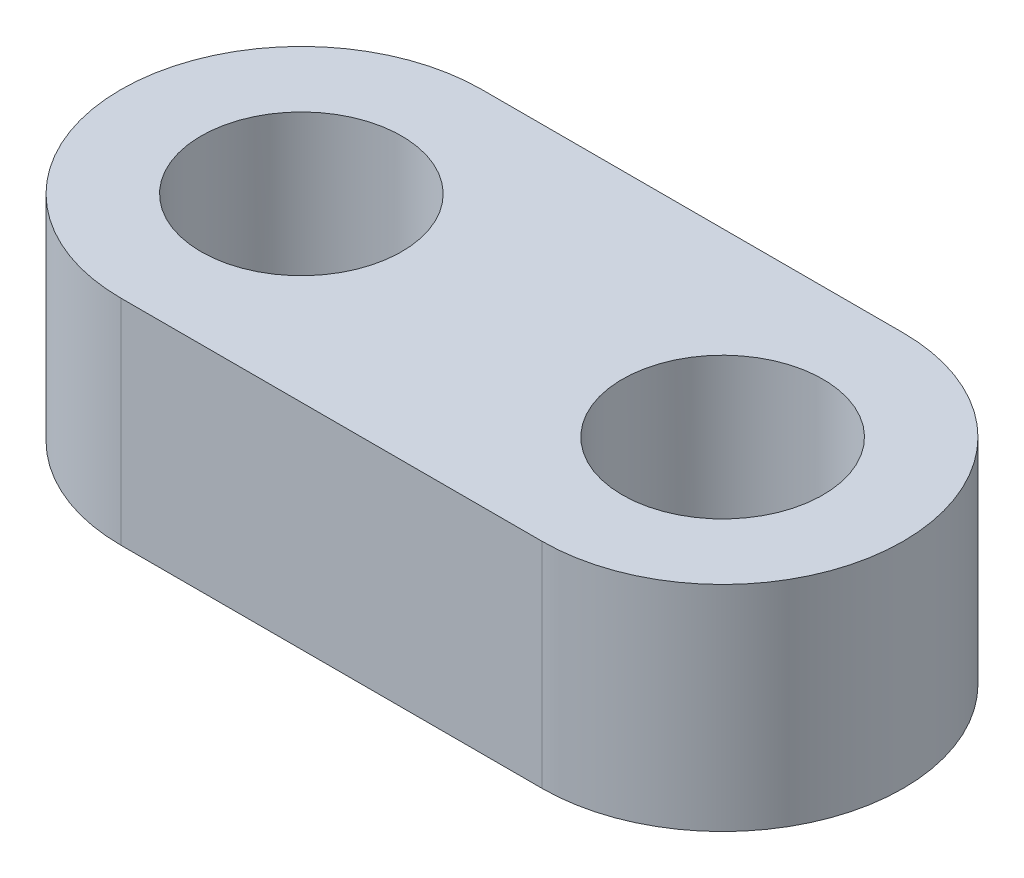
ISO-10303-21;
HEADER;
FILE_DESCRIPTION(('STEP AP214'),'2;1');
FILE_NAME('part.step','',(''),(''),'','','');
FILE_SCHEMA(('AUTOMOTIVE_DESIGN { 1 0 10303 214 1 1 1 1 }'));
ENDSEC;
DATA;
#1=APPLICATION_CONTEXT('core data for automotive mechanical design processes');
#2=APPLICATION_PROTOCOL_DEFINITION('international standard','automotive_design',2000,#1);
#3=PRODUCT_CONTEXT('',#1,'mechanical');
#4=PRODUCT('Part','Part','',(#3));
#5=PRODUCT_RELATED_PRODUCT_CATEGORY('part','',(#4));
#6=PRODUCT_DEFINITION_FORMATION('','',#4);
#7=PRODUCT_DEFINITION_CONTEXT('part definition',#1,'design');
#8=PRODUCT_DEFINITION('design','',#6,#7);
#9=PRODUCT_DEFINITION_SHAPE('','',#8);
#10=(LENGTH_UNIT() NAMED_UNIT(*) SI_UNIT(.MILLI.,.METRE.));
#11=(NAMED_UNIT(*) PLANE_ANGLE_UNIT() SI_UNIT($,.RADIAN.));
#12=(NAMED_UNIT(*) SI_UNIT($,.STERADIAN.) SOLID_ANGLE_UNIT());
#13=UNCERTAINTY_MEASURE_WITH_UNIT(LENGTH_MEASURE(1.E-05),#10,'distance_accuracy_value','');
#14=(GEOMETRIC_REPRESENTATION_CONTEXT(3) GLOBAL_UNCERTAINTY_ASSIGNED_CONTEXT((#13)) GLOBAL_UNIT_ASSIGNED_CONTEXT((#10,
#11,#12)) REPRESENTATION_CONTEXT('',''));
#15=CARTESIAN_POINT('',(0.,0.,0.));
#16=DIRECTION('',(0.,0.,1.));
#17=DIRECTION('',(1.,0.,0.));
#18=AXIS2_PLACEMENT_3D('',#15,#16,#17);
#19=CARTESIAN_POINT('',(0.,0.,0.));
#20=DIRECTION('',(0.,1.,0.));
#21=DIRECTION('',(-1.,0.,0.));
#22=AXIS2_PLACEMENT_3D('',#19,#20,#21);
#23=CYLINDRICAL_SURFACE('',#22,2.7);
#24=DIRECTION('',(0.,-1.,0.));
#25=VECTOR('',#24,1.);
#26=CARTESIAN_POINT('',(0.,0.,2.7));
#27=LINE('',#26,#25);
#28=CARTESIAN_POINT('',(0.,-1.60000000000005,2.7));
#29=VERTEX_POINT('',#28);
#30=CARTESIAN_POINT('',(0.,1.59999999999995,2.7));
#31=VERTEX_POINT('',#30);
#32=EDGE_CURVE('E53',#29,#31,#27,.F.);
#33=ORIENTED_EDGE('',*,*,#32,.T.);
#34=CARTESIAN_POINT('',(0.,1.59999999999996,0.));
#35=DIRECTION('',(0.,1.,0.));
#36=DIRECTION('',(-1.,0.,0.));
#37=AXIS2_PLACEMENT_3D('',#34,#35,#36);
#38=CIRCLE('',#37,2.7);
#39=CARTESIAN_POINT('',(0.,1.59999999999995,-2.7));
#40=VERTEX_POINT('',#39);
#41=EDGE_CURVE('E61',#31,#40,#38,.F.);
#42=ORIENTED_EDGE('',*,*,#41,.T.);
#43=DIRECTION('',(0.,1.,0.));
#44=VECTOR('',#43,1.);
#45=CARTESIAN_POINT('',(0.,0.,-2.7));
#46=LINE('',#45,#44);
#47=CARTESIAN_POINT('',(0.,-1.60000000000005,-2.7));
#48=VERTEX_POINT('',#47);
#49=EDGE_CURVE('E58',#40,#48,#46,.F.);
#50=ORIENTED_EDGE('',*,*,#49,.T.);
#51=CARTESIAN_POINT('',(0.,-1.60000000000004,0.));
#52=DIRECTION('',(0.,1.,0.));
#53=DIRECTION('',(-1.,0.,0.));
#54=AXIS2_PLACEMENT_3D('',#51,#52,#53);
#55=CIRCLE('',#54,2.7);
#56=EDGE_CURVE('E18',#48,#29,#55,.T.);
#57=ORIENTED_EDGE('',*,*,#56,.T.);
#58=EDGE_LOOP('',(#33,#42,#50,#57));
#59=FACE_BOUND('',#58,.T.);
#60=ADVANCED_FACE('F14',(#59),#23,.T.);
#61=CARTESIAN_POINT('',(6.3,0.,2.7));
#62=DIRECTION('',(0.,0.,-1.));
#63=DIRECTION('',(1.,0.,0.));
#64=AXIS2_PLACEMENT_3D('',#61,#62,#63);
#65=PLANE('',#64);
#66=ORIENTED_EDGE('',*,*,#32,.F.);
#67=DIRECTION('',(-1.,0.,0.));
#68=VECTOR('',#67,1.);
#69=CARTESIAN_POINT('',(6.3,-1.60000000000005,2.7));
#70=LINE('',#69,#68);
#71=CARTESIAN_POINT('',(6.3,-1.60000000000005,2.7));
#72=VERTEX_POINT('',#71);
#73=EDGE_CURVE('E72',#29,#72,#70,.F.);
#74=ORIENTED_EDGE('',*,*,#73,.T.);
#75=DIRECTION('',(0.,1.,0.));
#76=VECTOR('',#75,1.);
#77=CARTESIAN_POINT('',(6.3,0.,2.7));
#78=LINE('',#77,#76);
#79=CARTESIAN_POINT('',(6.3,1.59999999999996,2.7));
#80=VERTEX_POINT('',#79);
#81=EDGE_CURVE('E24',#80,#72,#78,.F.);
#82=ORIENTED_EDGE('',*,*,#81,.F.);
#83=DIRECTION('',(1.,0.,0.));
#84=VECTOR('',#83,1.);
#85=CARTESIAN_POINT('',(6.3,1.59999999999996,2.7));
#86=LINE('',#85,#84);
#87=EDGE_CURVE('E85',#31,#80,#86,.T.);
#88=ORIENTED_EDGE('',*,*,#87,.F.);
#89=EDGE_LOOP('',(#66,#74,#82,#88));
#90=FACE_BOUND('',#89,.T.);
#91=ADVANCED_FACE('F84',(#90),#65,.F.);
#92=CARTESIAN_POINT('',(6.3,1.59999999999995,0.));
#93=DIRECTION('',(0.,1.,0.));
#94=DIRECTION('',(-1.,0.,0.));
#95=AXIS2_PLACEMENT_3D('',#92,#93,#94);
#96=PLANE('',#95);
#97=CARTESIAN_POINT('',(0.,1.59999999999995,0.));
#98=DIRECTION('',(0.,1.,0.));
#99=DIRECTION('',(0.,0.,1.));
#100=AXIS2_PLACEMENT_3D('',#97,#98,#99);
#101=CIRCLE('',#100,1.5);
#102=CARTESIAN_POINT('',(0.,1.59999999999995,1.5));
#103=VERTEX_POINT('',#102);
#104=EDGE_CURVE('E77',#103,#103,#101,.T.);
#105=ORIENTED_EDGE('',*,*,#104,.F.);
#106=EDGE_LOOP('',(#105));
#107=FACE_BOUND('',#106,.T.);
#108=CARTESIAN_POINT('',(6.3,1.59999999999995,0.));
#109=DIRECTION('',(0.,1.,0.));
#110=DIRECTION('',(0.,0.,1.));
#111=AXIS2_PLACEMENT_3D('',#108,#109,#110);
#112=CIRCLE('',#111,1.5);
#113=CARTESIAN_POINT('',(6.3,1.59999999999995,1.49999999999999));
#114=VERTEX_POINT('',#113);
#115=EDGE_CURVE('E125',#114,#114,#112,.T.);
#116=ORIENTED_EDGE('',*,*,#115,.F.);
#117=EDGE_LOOP('',(#116));
#118=FACE_BOUND('',#117,.T.);
#119=ORIENTED_EDGE('',*,*,#41,.F.);
#120=ORIENTED_EDGE('',*,*,#87,.T.);
#121=CARTESIAN_POINT('',(6.3,1.59999999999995,0.));
#122=DIRECTION('',(0.,1.,0.));
#123=DIRECTION('',(-1.,0.,0.));
#124=AXIS2_PLACEMENT_3D('',#121,#122,#123);
#125=CIRCLE('',#124,2.7);
#126=CARTESIAN_POINT('',(6.3,1.59999999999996,-2.7));
#127=VERTEX_POINT('',#126);
#128=EDGE_CURVE('E32',#127,#80,#125,.F.);
#129=ORIENTED_EDGE('',*,*,#128,.F.);
#130=DIRECTION('',(1.,0.,0.));
#131=VECTOR('',#130,1.);
#132=CARTESIAN_POINT('',(6.3,1.59999999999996,-2.7));
#133=LINE('',#132,#131);
#134=EDGE_CURVE('E65',#127,#40,#133,.F.);
#135=ORIENTED_EDGE('',*,*,#134,.T.);
#136=EDGE_LOOP('',(#119,#120,#129,#135));
#137=FACE_BOUND('',#136,.T.);
#138=ADVANCED_FACE('F94',(#107,#118,#137),#96,.T.);
#139=CARTESIAN_POINT('',(6.3,0.,-2.7));
#140=DIRECTION('',(0.,0.,1.));
#141=DIRECTION('',(0.,-1.,0.));
#142=AXIS2_PLACEMENT_3D('',#139,#140,#141);
#143=PLANE('',#142);
#144=DIRECTION('',(0.,1.,0.));
#145=VECTOR('',#144,1.);
#146=CARTESIAN_POINT('',(6.3,0.,-2.7));
#147=LINE('',#146,#145);
#148=CARTESIAN_POINT('',(6.3,-1.60000000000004,-2.7));
#149=VERTEX_POINT('',#148);
#150=EDGE_CURVE('E9',#149,#127,#147,.T.);
#151=ORIENTED_EDGE('',*,*,#150,.F.);
#152=DIRECTION('',(-1.,0.,0.));
#153=VECTOR('',#152,1.);
#154=CARTESIAN_POINT('',(6.3,-1.60000000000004,-2.7));
#155=LINE('',#154,#153);
#156=EDGE_CURVE('E70',#149,#48,#155,.T.);
#157=ORIENTED_EDGE('',*,*,#156,.T.);
#158=ORIENTED_EDGE('',*,*,#49,.F.);
#159=ORIENTED_EDGE('',*,*,#134,.F.);
#160=EDGE_LOOP('',(#151,#157,#158,#159));
#161=FACE_BOUND('',#160,.T.);
#162=ADVANCED_FACE('F73',(#161),#143,.F.);
#163=CARTESIAN_POINT('',(6.3,0.,0.));
#164=DIRECTION('',(0.,1.,0.));
#165=DIRECTION('',(-1.,0.,0.));
#166=AXIS2_PLACEMENT_3D('',#163,#164,#165);
#167=CYLINDRICAL_SURFACE('',#166,2.7);
#168=ORIENTED_EDGE('',*,*,#81,.T.);
#169=CARTESIAN_POINT('',(6.3,-1.60000000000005,0.));
#170=DIRECTION('',(0.,1.,0.));
#171=DIRECTION('',(-1.,0.,0.));
#172=AXIS2_PLACEMENT_3D('',#169,#170,#171);
#173=CIRCLE('',#172,2.7);
#174=EDGE_CURVE('E81',#72,#149,#173,.T.);
#175=ORIENTED_EDGE('',*,*,#174,.T.);
#176=ORIENTED_EDGE('',*,*,#150,.T.);
#177=ORIENTED_EDGE('',*,*,#128,.T.);
#178=EDGE_LOOP('',(#168,#175,#176,#177));
#179=FACE_BOUND('',#178,.T.);
#180=ADVANCED_FACE('F95',(#179),#167,.T.);
#181=CARTESIAN_POINT('',(6.3,-1.60000000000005,0.));
#182=DIRECTION('',(0.,1.,0.));
#183=DIRECTION('',(-1.,0.,0.));
#184=AXIS2_PLACEMENT_3D('',#181,#182,#183);
#185=PLANE('',#184);
#186=CARTESIAN_POINT('',(0.,-1.60000000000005,0.));
#187=DIRECTION('',(0.,1.,0.));
#188=DIRECTION('',(-1.,0.,0.));
#189=AXIS2_PLACEMENT_3D('',#186,#187,#188);
#190=CIRCLE('',#189,1.5);
#191=CARTESIAN_POINT('',(-1.5,-1.60000000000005,0.));
#192=VERTEX_POINT('',#191);
#193=EDGE_CURVE('E74',#192,#192,#190,.F.);
#194=ORIENTED_EDGE('',*,*,#193,.F.);
#195=EDGE_LOOP('',(#194));
#196=FACE_BOUND('',#195,.T.);
#197=CARTESIAN_POINT('',(6.3,-1.60000000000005,0.));
#198=DIRECTION('',(0.,1.,0.));
#199=DIRECTION('',(-1.,0.,0.));
#200=AXIS2_PLACEMENT_3D('',#197,#198,#199);
#201=CIRCLE('',#200,1.5);
#202=CARTESIAN_POINT('',(4.8,-1.60000000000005,0.));
#203=VERTEX_POINT('',#202);
#204=EDGE_CURVE('E89',#203,#203,#201,.F.);
#205=ORIENTED_EDGE('',*,*,#204,.F.);
#206=EDGE_LOOP('',(#205));
#207=FACE_BOUND('',#206,.T.);
#208=ORIENTED_EDGE('',*,*,#73,.F.);
#209=ORIENTED_EDGE('',*,*,#56,.F.);
#210=ORIENTED_EDGE('',*,*,#156,.F.);
#211=ORIENTED_EDGE('',*,*,#174,.F.);
#212=EDGE_LOOP('',(#208,#209,#210,#211));
#213=FACE_BOUND('',#212,.T.);
#214=ADVANCED_FACE('F16',(#196,#207,#213),#185,.F.);
#215=CARTESIAN_POINT('',(6.3,-5.84264068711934,0.));
#216=DIRECTION('',(0.,1.,0.));
#217=DIRECTION('',(0.,0.,1.));
#218=AXIS2_PLACEMENT_3D('',#215,#216,#217);
#219=CYLINDRICAL_SURFACE('',#218,1.5);
#220=ORIENTED_EDGE('',*,*,#204,.T.);
#221=EDGE_LOOP('',(#220));
#222=FACE_BOUND('',#221,.T.);
#223=ORIENTED_EDGE('',*,*,#115,.T.);
#224=EDGE_LOOP('',(#223));
#225=FACE_BOUND('',#224,.T.);
#226=ADVANCED_FACE('F104',(#222,#225),#219,.F.);
#227=CARTESIAN_POINT('',(0.,-5.84264068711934,0.));
#228=DIRECTION('',(0.,1.,0.));
#229=DIRECTION('',(0.,0.,1.));
#230=AXIS2_PLACEMENT_3D('',#227,#228,#229);
#231=CYLINDRICAL_SURFACE('',#230,1.5);
#232=ORIENTED_EDGE('',*,*,#193,.T.);
#233=EDGE_LOOP('',(#232));
#234=FACE_BOUND('',#233,.T.);
#235=ORIENTED_EDGE('',*,*,#104,.T.);
#236=EDGE_LOOP('',(#235));
#237=FACE_BOUND('',#236,.T.);
#238=ADVANCED_FACE('F130',(#234,#237),#231,.F.);
#239=CLOSED_SHELL('',(#60,#91,#138,#162,#180,#214,#226,#238));
#240=MANIFOLD_SOLID_BREP('B1',#239);
#241=ADVANCED_BREP_SHAPE_REPRESENTATION('',(#18,#240),#14);
#242=SHAPE_DEFINITION_REPRESENTATION(#9,#241);
ENDSEC;
END-ISO-10303-21;
